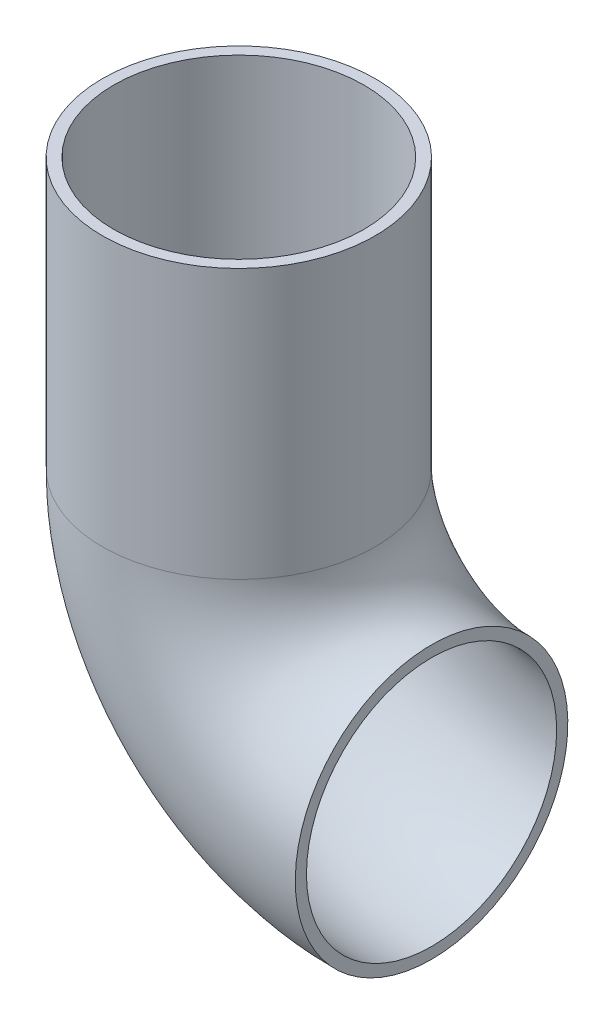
from build123d import *

# Parameters (mm, degrees)
SWEEP_THIN1_PROFILE_R   = 22.44725
SWEEP_THIN1_PROFILE_R_2 = 20.60575


with BuildPart() as part:
    # Sweep-Thin1: sweep along a path in Sketch1
    with BuildLine(Plane.XY) as sweep_thin1_path:
        Line((0, 76.117808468), (0, 31.75))
        ThreePointArc((0, 31.75), (9.299359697, 9.299359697), (31.75, 0))
    # Sweep-Thin1 profile (on start of the path) → Sweep-Thin1 (sweep)
    with BuildSketch(Plane(origin=(0, 76.117808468, 0), x_dir=(0, 0, -1), z_dir=(0, -1, 0))):
        Circle(SWEEP_THIN1_PROFILE_R)
        Circle(SWEEP_THIN1_PROFILE_R_2, mode=Mode.SUBTRACT)
    sweep(path=sweep_thin1_path.line)


solid = part.part
